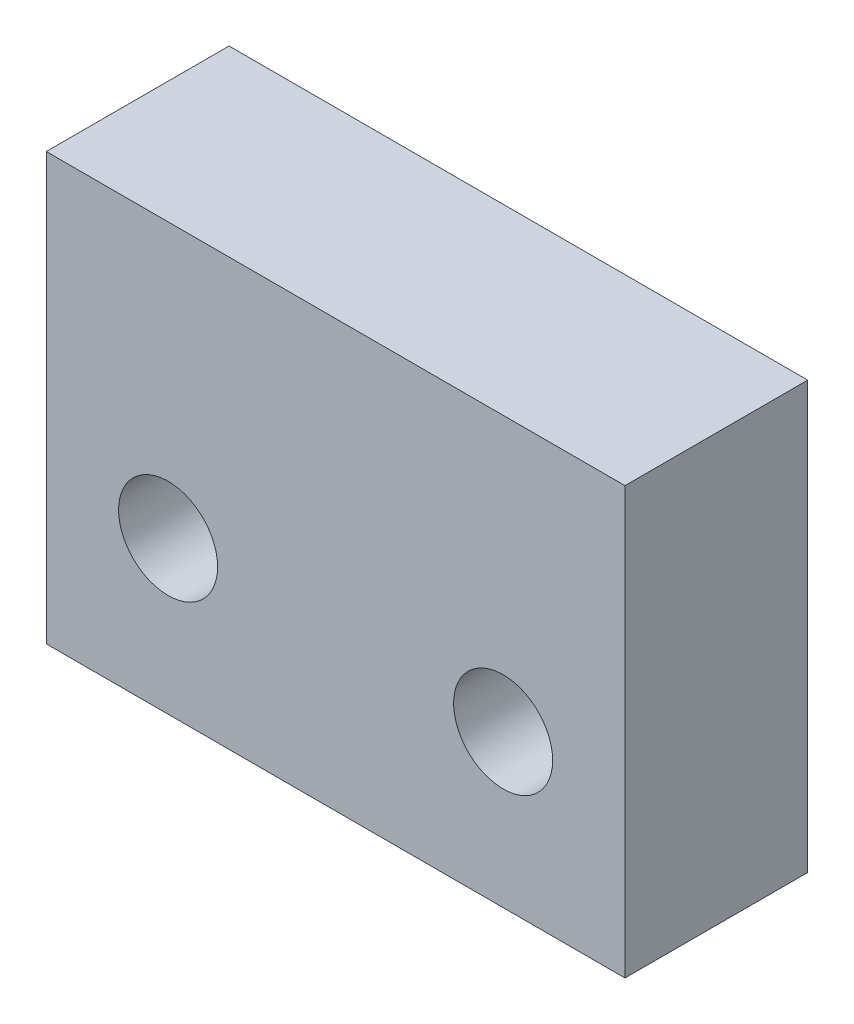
ISO-10303-21;
HEADER;
FILE_DESCRIPTION(('STEP AP214'),'2;1');
FILE_NAME('part.step','',(''),(''),'','','');
FILE_SCHEMA(('AUTOMOTIVE_DESIGN { 1 0 10303 214 1 1 1 1 }'));
ENDSEC;
DATA;
#1=APPLICATION_CONTEXT('core data for automotive mechanical design processes');
#2=APPLICATION_PROTOCOL_DEFINITION('international standard','automotive_design',2000,#1);
#3=PRODUCT_CONTEXT('',#1,'mechanical');
#4=PRODUCT('Part','Part','',(#3));
#5=PRODUCT_RELATED_PRODUCT_CATEGORY('part','',(#4));
#6=PRODUCT_DEFINITION_FORMATION('','',#4);
#7=PRODUCT_DEFINITION_CONTEXT('part definition',#1,'design');
#8=PRODUCT_DEFINITION('design','',#6,#7);
#9=PRODUCT_DEFINITION_SHAPE('','',#8);
#10=(LENGTH_UNIT() NAMED_UNIT(*) SI_UNIT(.MILLI.,.METRE.));
#11=(NAMED_UNIT(*) PLANE_ANGLE_UNIT() SI_UNIT($,.RADIAN.));
#12=(NAMED_UNIT(*) SI_UNIT($,.STERADIAN.) SOLID_ANGLE_UNIT());
#13=UNCERTAINTY_MEASURE_WITH_UNIT(LENGTH_MEASURE(1.E-05),#10,'distance_accuracy_value','');
#14=(GEOMETRIC_REPRESENTATION_CONTEXT(3) GLOBAL_UNCERTAINTY_ASSIGNED_CONTEXT((#13)) GLOBAL_UNIT_ASSIGNED_CONTEXT((#10,
#11,#12)) REPRESENTATION_CONTEXT('',''));
#15=CARTESIAN_POINT('',(0.,0.,0.));
#16=DIRECTION('',(0.,0.,1.));
#17=DIRECTION('',(1.,0.,0.));
#18=AXIS2_PLACEMENT_3D('',#15,#16,#17);
#19=CARTESIAN_POINT('',(0.,0.,12.));
#20=DIRECTION('',(0.,0.,-1.));
#21=DIRECTION('',(-1.,0.,0.));
#22=AXIS2_PLACEMENT_3D('',#19,#20,#21);
#23=PLANE('',#22);
#24=CARTESIAN_POINT('',(8.,-18.,12.));
#25=DIRECTION('',(0.,0.,1.));
#26=DIRECTION('',(1.,0.,0.));
#27=AXIS2_PLACEMENT_3D('',#24,#25,#26);
#28=CIRCLE('',#27,3.25);
#29=CARTESIAN_POINT('',(11.25,-18.,12.));
#30=VERTEX_POINT('',#29);
#31=EDGE_CURVE('E99',#30,#30,#28,.T.);
#32=ORIENTED_EDGE('',*,*,#31,.F.);
#33=EDGE_LOOP('',(#32));
#34=FACE_BOUND('',#33,.T.);
#35=DIRECTION('',(0.,-1.,0.));
#36=VECTOR('',#35,1.);
#37=CARTESIAN_POINT('',(0.,-28.,12.));
#38=LINE('',#37,#36);
#39=CARTESIAN_POINT('',(0.,0.,12.));
#40=VERTEX_POINT('',#39);
#41=CARTESIAN_POINT('',(0.,-28.,12.));
#42=VERTEX_POINT('',#41);
#43=EDGE_CURVE('E84',#40,#42,#38,.T.);
#44=ORIENTED_EDGE('',*,*,#43,.T.);
#45=DIRECTION('',(1.,0.,0.));
#46=VECTOR('',#45,1.);
#47=CARTESIAN_POINT('',(0.,-28.,12.));
#48=LINE('',#47,#46);
#49=CARTESIAN_POINT('',(38.,-28.,12.));
#50=VERTEX_POINT('',#49);
#51=EDGE_CURVE('E79',#42,#50,#48,.T.);
#52=ORIENTED_EDGE('',*,*,#51,.T.);
#53=DIRECTION('',(0.,1.,0.));
#54=VECTOR('',#53,1.);
#55=CARTESIAN_POINT('',(38.,-28.,12.));
#56=LINE('',#55,#54);
#57=CARTESIAN_POINT('',(38.,0.,12.));
#58=VERTEX_POINT('',#57);
#59=EDGE_CURVE('E82',#50,#58,#56,.T.);
#60=ORIENTED_EDGE('',*,*,#59,.T.);
#61=DIRECTION('',(-1.,0.,0.));
#62=VECTOR('',#61,1.);
#63=CARTESIAN_POINT('',(0.,0.,12.));
#64=LINE('',#63,#62);
#65=EDGE_CURVE('E49',#58,#40,#64,.T.);
#66=ORIENTED_EDGE('',*,*,#65,.T.);
#67=EDGE_LOOP('',(#44,#52,#60,#66));
#68=FACE_BOUND('',#67,.T.);
#69=CARTESIAN_POINT('',(30.,-18.,12.));
#70=DIRECTION('',(0.,0.,1.));
#71=DIRECTION('',(1.,0.,0.));
#72=AXIS2_PLACEMENT_3D('',#69,#70,#71);
#73=CIRCLE('',#72,3.25);
#74=CARTESIAN_POINT('',(33.25,-18.,12.));
#75=VERTEX_POINT('',#74);
#76=EDGE_CURVE('E114',#75,#75,#73,.T.);
#77=ORIENTED_EDGE('',*,*,#76,.F.);
#78=EDGE_LOOP('',(#77));
#79=FACE_BOUND('',#78,.T.);
#80=ADVANCED_FACE('F32',(#34,#68,#79),#23,.F.);
#81=CARTESIAN_POINT('',(0.,0.,0.));
#82=DIRECTION('',(0.,0.,-1.));
#83=DIRECTION('',(-1.,0.,0.));
#84=AXIS2_PLACEMENT_3D('',#81,#82,#83);
#85=PLANE('',#84);
#86=CARTESIAN_POINT('',(8.,-18.,0.));
#87=DIRECTION('',(0.,0.,1.));
#88=DIRECTION('',(1.,0.,0.));
#89=AXIS2_PLACEMENT_3D('',#86,#87,#88);
#90=CIRCLE('',#89,3.25);
#91=CARTESIAN_POINT('',(11.25,-18.,0.));
#92=VERTEX_POINT('',#91);
#93=EDGE_CURVE('E111',#92,#92,#90,.T.);
#94=ORIENTED_EDGE('',*,*,#93,.T.);
#95=EDGE_LOOP('',(#94));
#96=FACE_BOUND('',#95,.T.);
#97=DIRECTION('',(0.,-1.,0.));
#98=VECTOR('',#97,1.);
#99=CARTESIAN_POINT('',(0.,-28.,0.));
#100=LINE('',#99,#98);
#101=CARTESIAN_POINT('',(0.,0.,0.));
#102=VERTEX_POINT('',#101);
#103=CARTESIAN_POINT('',(0.,-28.,0.));
#104=VERTEX_POINT('',#103);
#105=EDGE_CURVE('E96',#102,#104,#100,.T.);
#106=ORIENTED_EDGE('',*,*,#105,.F.);
#107=DIRECTION('',(-1.,0.,0.));
#108=VECTOR('',#107,1.);
#109=CARTESIAN_POINT('',(0.,0.,0.));
#110=LINE('',#109,#108);
#111=CARTESIAN_POINT('',(38.,0.,0.));
#112=VERTEX_POINT('',#111);
#113=EDGE_CURVE('E72',#112,#102,#110,.T.);
#114=ORIENTED_EDGE('',*,*,#113,.F.);
#115=DIRECTION('',(0.,1.,0.));
#116=VECTOR('',#115,1.);
#117=CARTESIAN_POINT('',(38.,-28.,0.));
#118=LINE('',#117,#116);
#119=CARTESIAN_POINT('',(38.,-28.,0.));
#120=VERTEX_POINT('',#119);
#121=EDGE_CURVE('E66',#120,#112,#118,.T.);
#122=ORIENTED_EDGE('',*,*,#121,.F.);
#123=DIRECTION('',(1.,0.,0.));
#124=VECTOR('',#123,1.);
#125=CARTESIAN_POINT('',(0.,-28.,0.));
#126=LINE('',#125,#124);
#127=EDGE_CURVE('E88',#104,#120,#126,.T.);
#128=ORIENTED_EDGE('',*,*,#127,.F.);
#129=EDGE_LOOP('',(#106,#114,#122,#128));
#130=FACE_BOUND('',#129,.T.);
#131=CARTESIAN_POINT('',(30.,-18.,0.));
#132=DIRECTION('',(0.,0.,1.));
#133=DIRECTION('',(1.,0.,0.));
#134=AXIS2_PLACEMENT_3D('',#131,#132,#133);
#135=CIRCLE('',#134,3.25);
#136=CARTESIAN_POINT('',(33.25,-18.,0.));
#137=VERTEX_POINT('',#136);
#138=EDGE_CURVE('E117',#137,#137,#135,.T.);
#139=ORIENTED_EDGE('',*,*,#138,.T.);
#140=EDGE_LOOP('',(#139));
#141=FACE_BOUND('',#140,.T.);
#142=ADVANCED_FACE('F107',(#96,#130,#141),#85,.T.);
#143=CARTESIAN_POINT('',(0.,-28.,12.));
#144=DIRECTION('',(1.,0.,0.));
#145=DIRECTION('',(0.,0.,-1.));
#146=AXIS2_PLACEMENT_3D('',#143,#144,#145);
#147=PLANE('',#146);
#148=ORIENTED_EDGE('',*,*,#105,.T.);
#149=DIRECTION('',(0.,0.,-1.));
#150=VECTOR('',#149,1.);
#151=CARTESIAN_POINT('',(0.,-28.,12.));
#152=LINE('',#151,#150);
#153=EDGE_CURVE('E11',#42,#104,#152,.T.);
#154=ORIENTED_EDGE('',*,*,#153,.F.);
#155=ORIENTED_EDGE('',*,*,#43,.F.);
#156=DIRECTION('',(0.,0.,-1.));
#157=VECTOR('',#156,1.);
#158=CARTESIAN_POINT('',(0.,0.,12.));
#159=LINE('',#158,#157);
#160=EDGE_CURVE('E92',#40,#102,#159,.T.);
#161=ORIENTED_EDGE('',*,*,#160,.T.);
#162=EDGE_LOOP('',(#148,#154,#155,#161));
#163=FACE_BOUND('',#162,.T.);
#164=ADVANCED_FACE('F34',(#163),#147,.F.);
#165=CARTESIAN_POINT('',(0.,-28.,12.));
#166=DIRECTION('',(0.,1.,0.));
#167=DIRECTION('',(0.,0.,1.));
#168=AXIS2_PLACEMENT_3D('',#165,#166,#167);
#169=PLANE('',#168);
#170=ORIENTED_EDGE('',*,*,#127,.T.);
#171=DIRECTION('',(0.,0.,-1.));
#172=VECTOR('',#171,1.);
#173=CARTESIAN_POINT('',(38.,-28.,12.));
#174=LINE('',#173,#172);
#175=EDGE_CURVE('E41',#50,#120,#174,.T.);
#176=ORIENTED_EDGE('',*,*,#175,.F.);
#177=ORIENTED_EDGE('',*,*,#51,.F.);
#178=ORIENTED_EDGE('',*,*,#153,.T.);
#179=EDGE_LOOP('',(#170,#176,#177,#178));
#180=FACE_BOUND('',#179,.T.);
#181=ADVANCED_FACE('F87',(#180),#169,.F.);
#182=CARTESIAN_POINT('',(38.,-28.,12.));
#183=DIRECTION('',(-1.,0.,0.));
#184=DIRECTION('',(0.,0.,1.));
#185=AXIS2_PLACEMENT_3D('',#182,#183,#184);
#186=PLANE('',#185);
#187=ORIENTED_EDGE('',*,*,#121,.T.);
#188=DIRECTION('',(0.,0.,-1.));
#189=VECTOR('',#188,1.);
#190=CARTESIAN_POINT('',(38.,0.,12.));
#191=LINE('',#190,#189);
#192=EDGE_CURVE('E89',#58,#112,#191,.T.);
#193=ORIENTED_EDGE('',*,*,#192,.F.);
#194=ORIENTED_EDGE('',*,*,#59,.F.);
#195=ORIENTED_EDGE('',*,*,#175,.T.);
#196=EDGE_LOOP('',(#187,#193,#194,#195));
#197=FACE_BOUND('',#196,.T.);
#198=ADVANCED_FACE('F90',(#197),#186,.F.);
#199=CARTESIAN_POINT('',(0.,0.,12.));
#200=DIRECTION('',(0.,-1.,0.));
#201=DIRECTION('',(0.,0.,-1.));
#202=AXIS2_PLACEMENT_3D('',#199,#200,#201);
#203=PLANE('',#202);
#204=ORIENTED_EDGE('',*,*,#113,.T.);
#205=ORIENTED_EDGE('',*,*,#160,.F.);
#206=ORIENTED_EDGE('',*,*,#65,.F.);
#207=ORIENTED_EDGE('',*,*,#192,.T.);
#208=EDGE_LOOP('',(#204,#205,#206,#207));
#209=FACE_BOUND('',#208,.T.);
#210=ADVANCED_FACE('F104',(#209),#203,.F.);
#211=CARTESIAN_POINT('',(8.,-18.,12.));
#212=DIRECTION('',(0.,0.,-1.));
#213=DIRECTION('',(-1.,0.,0.));
#214=AXIS2_PLACEMENT_3D('',#211,#212,#213);
#215=CYLINDRICAL_SURFACE('',#214,3.25);
#216=ORIENTED_EDGE('',*,*,#31,.T.);
#217=EDGE_LOOP('',(#216));
#218=FACE_BOUND('',#217,.T.);
#219=ORIENTED_EDGE('',*,*,#93,.F.);
#220=EDGE_LOOP('',(#219));
#221=FACE_BOUND('',#220,.T.);
#222=ADVANCED_FACE('F135',(#218,#221),#215,.F.);
#223=CARTESIAN_POINT('',(30.,-18.,12.));
#224=DIRECTION('',(0.,0.,-1.));
#225=DIRECTION('',(-1.,0.,0.));
#226=AXIS2_PLACEMENT_3D('',#223,#224,#225);
#227=CYLINDRICAL_SURFACE('',#226,3.25);
#228=ORIENTED_EDGE('',*,*,#76,.T.);
#229=EDGE_LOOP('',(#228));
#230=FACE_BOUND('',#229,.T.);
#231=ORIENTED_EDGE('',*,*,#138,.F.);
#232=EDGE_LOOP('',(#231));
#233=FACE_BOUND('',#232,.T.);
#234=ADVANCED_FACE('F123',(#230,#233),#227,.F.);
#235=CLOSED_SHELL('',(#80,#142,#164,#181,#198,#210,#222,#234));
#236=MANIFOLD_SOLID_BREP('B2',#235);
#237=ADVANCED_BREP_SHAPE_REPRESENTATION('',(#18,#236),#14);
#238=SHAPE_DEFINITION_REPRESENTATION(#9,#237);
ENDSEC;
END-ISO-10303-21;
